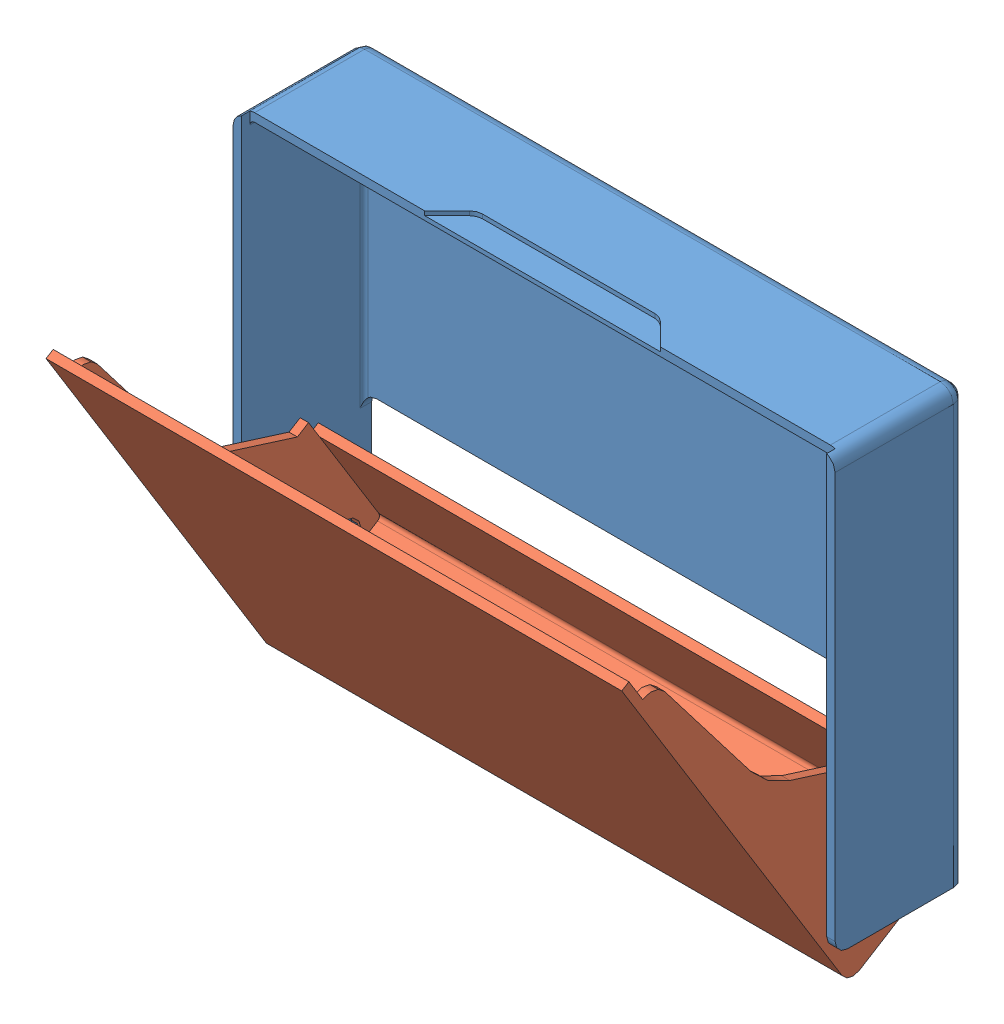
SolidWorks assembly Tape Case.SLDASM, configuration Default (file format 4700). Lengths in mm.
Overall size (73.03 57.75 41.04).
2 component instances, 2 part files, 5 mates.
Components (placement in the parent):
- Outer Cover-1: Outer Cover.SLDPRT [Default] at (0 52.3875 0) x (-1 0 0) z (0 0 1) size (73.03 52.39 15.88)
- Inner Cover-1: Inner Cover.SLDPRT [Default] at (0 -5.3664 4.6975) x (-1 0 0) z (0 0.525561 -0.850756) size (69.85 52.39 15.88)
Mates (geometry in assembly coordinates):
- Coincident1: coincident anti-aligned: plane of Outer Cover-1 through (36.5125 0 7.9375) normal (0 -1 0); plane of assembly
- Coincident2: coincident anti-aligned: plane of Outer Cover-1; plane of assembly
- Coincident3: coincident aligned: plane of Outer Cover-1; plane of assembly
- Concentric1: concentric anti-aligned: cylinder of Outer Cover-1 through (33.909 3.175 -3.0878) axis (1 0 0) radius 1.651; cylinder of Inner Cover-1 through (34.925 3.175 -3.0878) axis (-1 0 0) radius 1.905
- Coincident4: coincident aligned: plane of Outer Cover-1; plane of Inner Cover-1
